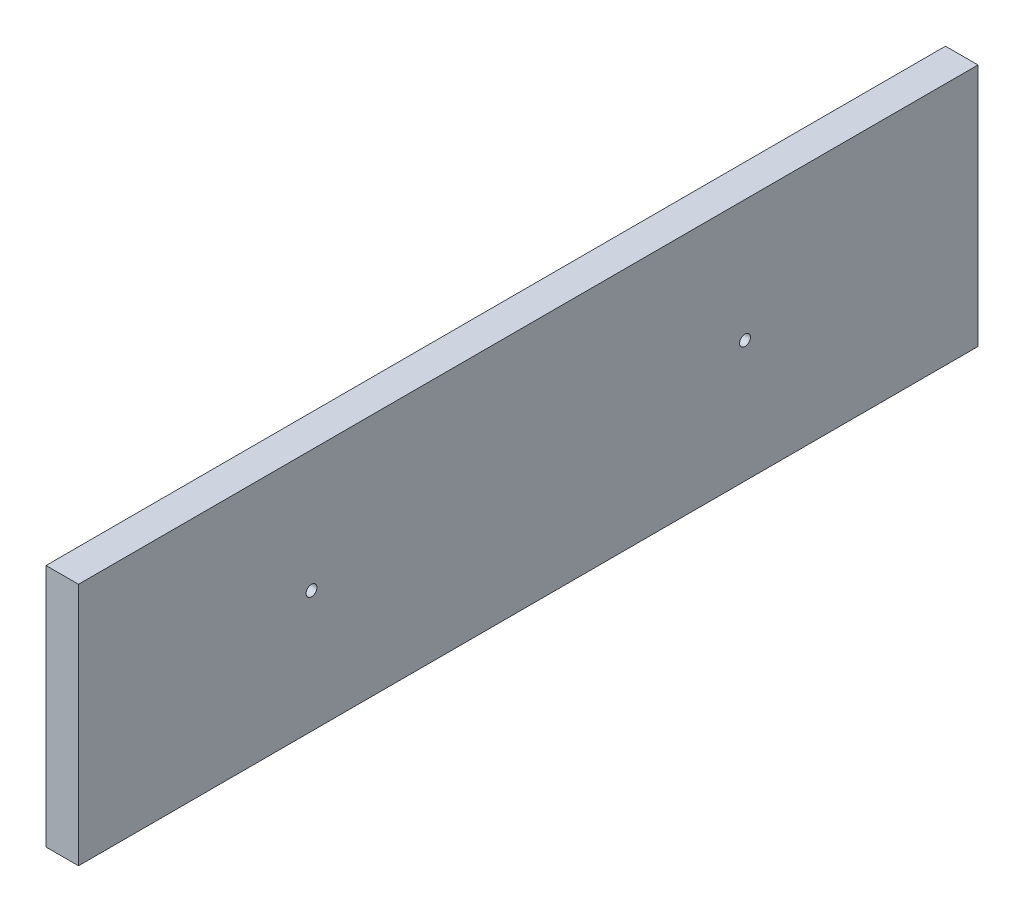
ISO-10303-21;
HEADER;
FILE_DESCRIPTION(('STEP AP214'),'2;1');
FILE_NAME('part.step','',(''),(''),'','','');
FILE_SCHEMA(('AUTOMOTIVE_DESIGN { 1 0 10303 214 1 1 1 1 }'));
ENDSEC;
DATA;
#1=APPLICATION_CONTEXT('core data for automotive mechanical design processes');
#2=APPLICATION_PROTOCOL_DEFINITION('international standard','automotive_design',2000,#1);
#3=PRODUCT_CONTEXT('',#1,'mechanical');
#4=PRODUCT('Part','Part','',(#3));
#5=PRODUCT_RELATED_PRODUCT_CATEGORY('part','',(#4));
#6=PRODUCT_DEFINITION_FORMATION('','',#4);
#7=PRODUCT_DEFINITION_CONTEXT('part definition',#1,'design');
#8=PRODUCT_DEFINITION('design','',#6,#7);
#9=PRODUCT_DEFINITION_SHAPE('','',#8);
#10=(LENGTH_UNIT() NAMED_UNIT(*) SI_UNIT(.MILLI.,.METRE.));
#11=(NAMED_UNIT(*) PLANE_ANGLE_UNIT() SI_UNIT($,.RADIAN.));
#12=(NAMED_UNIT(*) SI_UNIT($,.STERADIAN.) SOLID_ANGLE_UNIT());
#13=UNCERTAINTY_MEASURE_WITH_UNIT(LENGTH_MEASURE(1.E-05),#10,'distance_accuracy_value','');
#14=(GEOMETRIC_REPRESENTATION_CONTEXT(3) GLOBAL_UNCERTAINTY_ASSIGNED_CONTEXT((#13)) GLOBAL_UNIT_ASSIGNED_CONTEXT((#10,
#11,#12)) REPRESENTATION_CONTEXT('',''));
#15=CARTESIAN_POINT('',(0.,0.,0.));
#16=DIRECTION('',(0.,0.,1.));
#17=DIRECTION('',(1.,0.,0.));
#18=AXIS2_PLACEMENT_3D('',#15,#16,#17);
#19=CARTESIAN_POINT('',(0.,0.,1054.1));
#20=DIRECTION('',(1.,0.,0.));
#21=DIRECTION('',(0.,0.,-1.));
#22=AXIS2_PLACEMENT_3D('',#19,#20,#21);
#23=PLANE('',#22);
#24=CARTESIAN_POINT('',(0.,142.875,781.05));
#25=DIRECTION('',(1.,0.,0.));
#26=DIRECTION('',(0.,0.,-1.));
#27=AXIS2_PLACEMENT_3D('',#24,#25,#26);
#28=CIRCLE('',#27,6.34999999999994);
#29=CARTESIAN_POINT('',(0.,142.875,774.7));
#30=VERTEX_POINT('',#29);
#31=EDGE_CURVE('E105',#30,#30,#28,.T.);
#32=ORIENTED_EDGE('',*,*,#31,.T.);
#33=EDGE_LOOP('',(#32));
#34=FACE_BOUND('',#33,.T.);
#35=CARTESIAN_POINT('',(0.,142.875,273.05));
#36=DIRECTION('',(1.,0.,0.));
#37=DIRECTION('',(0.,0.,-1.));
#38=AXIS2_PLACEMENT_3D('',#35,#36,#37);
#39=CIRCLE('',#38,6.34999999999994);
#40=CARTESIAN_POINT('',(0.,142.875,266.7));
#41=VERTEX_POINT('',#40);
#42=EDGE_CURVE('E116',#41,#41,#39,.T.);
#43=ORIENTED_EDGE('',*,*,#42,.T.);
#44=EDGE_LOOP('',(#43));
#45=FACE_BOUND('',#44,.T.);
#46=DIRECTION('',(0.,-1.,0.));
#47=VECTOR('',#46,1.);
#48=CARTESIAN_POINT('',(0.,0.,0.));
#49=LINE('',#48,#47);
#50=CARTESIAN_POINT('',(0.,285.75,0.));
#51=VERTEX_POINT('',#50);
#52=CARTESIAN_POINT('',(0.,0.,0.));
#53=VERTEX_POINT('',#52);
#54=EDGE_CURVE('E102',#51,#53,#49,.T.);
#55=ORIENTED_EDGE('',*,*,#54,.T.);
#56=DIRECTION('',(0.,0.,-1.));
#57=VECTOR('',#56,1.);
#58=CARTESIAN_POINT('',(0.,0.,1054.1));
#59=LINE('',#58,#57);
#60=CARTESIAN_POINT('',(0.,0.,1054.1));
#61=VERTEX_POINT('',#60);
#62=EDGE_CURVE('E11',#61,#53,#59,.T.);
#63=ORIENTED_EDGE('',*,*,#62,.F.);
#64=DIRECTION('',(0.,-1.,0.));
#65=VECTOR('',#64,1.);
#66=CARTESIAN_POINT('',(0.,0.,1054.1));
#67=LINE('',#66,#65);
#68=CARTESIAN_POINT('',(0.,285.75,1054.1));
#69=VERTEX_POINT('',#68);
#70=EDGE_CURVE('E90',#69,#61,#67,.T.);
#71=ORIENTED_EDGE('',*,*,#70,.F.);
#72=DIRECTION('',(0.,0.,-1.));
#73=VECTOR('',#72,1.);
#74=CARTESIAN_POINT('',(0.,285.75,1054.1));
#75=LINE('',#74,#73);
#76=EDGE_CURVE('E98',#69,#51,#75,.T.);
#77=ORIENTED_EDGE('',*,*,#76,.T.);
#78=EDGE_LOOP('',(#55,#63,#71,#77));
#79=FACE_BOUND('',#78,.T.);
#80=ADVANCED_FACE('F39',(#34,#45,#79),#23,.F.);
#81=CARTESIAN_POINT('',(0.,0.,1054.1));
#82=DIRECTION('',(0.,1.,0.));
#83=DIRECTION('',(0.,0.,1.));
#84=AXIS2_PLACEMENT_3D('',#81,#82,#83);
#85=PLANE('',#84);
#86=DIRECTION('',(1.,0.,0.));
#87=VECTOR('',#86,1.);
#88=CARTESIAN_POINT('',(0.,0.,0.));
#89=LINE('',#88,#87);
#90=CARTESIAN_POINT('',(38.1,0.,0.));
#91=VERTEX_POINT('',#90);
#92=EDGE_CURVE('E94',#53,#91,#89,.T.);
#93=ORIENTED_EDGE('',*,*,#92,.T.);
#94=DIRECTION('',(0.,0.,-1.));
#95=VECTOR('',#94,1.);
#96=CARTESIAN_POINT('',(38.1,0.,1054.1));
#97=LINE('',#96,#95);
#98=CARTESIAN_POINT('',(38.1,0.,1054.1));
#99=VERTEX_POINT('',#98);
#100=EDGE_CURVE('E47',#99,#91,#97,.T.);
#101=ORIENTED_EDGE('',*,*,#100,.F.);
#102=DIRECTION('',(1.,0.,0.));
#103=VECTOR('',#102,1.);
#104=CARTESIAN_POINT('',(0.,0.,1054.1));
#105=LINE('',#104,#103);
#106=EDGE_CURVE('E85',#61,#99,#105,.T.);
#107=ORIENTED_EDGE('',*,*,#106,.F.);
#108=ORIENTED_EDGE('',*,*,#62,.T.);
#109=EDGE_LOOP('',(#93,#101,#107,#108));
#110=FACE_BOUND('',#109,.T.);
#111=ADVANCED_FACE('F93',(#110),#85,.F.);
#112=CARTESIAN_POINT('',(38.1,0.,1054.1));
#113=DIRECTION('',(-1.,0.,0.));
#114=DIRECTION('',(0.,-1.,0.));
#115=AXIS2_PLACEMENT_3D('',#112,#113,#114);
#116=PLANE('',#115);
#117=CARTESIAN_POINT('',(38.1,142.875,781.05));
#118=DIRECTION('',(1.,0.,0.));
#119=DIRECTION('',(0.,0.,-1.));
#120=AXIS2_PLACEMENT_3D('',#117,#118,#119);
#121=CIRCLE('',#120,6.34999999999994);
#122=CARTESIAN_POINT('',(38.1,142.875,774.7));
#123=VERTEX_POINT('',#122);
#124=EDGE_CURVE('E122',#123,#123,#121,.T.);
#125=ORIENTED_EDGE('',*,*,#124,.F.);
#126=EDGE_LOOP('',(#125));
#127=FACE_BOUND('',#126,.T.);
#128=CARTESIAN_POINT('',(38.1,142.875,273.05));
#129=DIRECTION('',(1.,0.,0.));
#130=DIRECTION('',(0.,0.,-1.));
#131=AXIS2_PLACEMENT_3D('',#128,#129,#130);
#132=CIRCLE('',#131,6.34999999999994);
#133=CARTESIAN_POINT('',(38.1,142.875,266.7));
#134=VERTEX_POINT('',#133);
#135=EDGE_CURVE('E119',#134,#134,#132,.T.);
#136=ORIENTED_EDGE('',*,*,#135,.F.);
#137=EDGE_LOOP('',(#136));
#138=FACE_BOUND('',#137,.T.);
#139=DIRECTION('',(0.,1.,0.));
#140=VECTOR('',#139,1.);
#141=CARTESIAN_POINT('',(38.1,0.,0.));
#142=LINE('',#141,#140);
#143=CARTESIAN_POINT('',(38.1,285.75,0.));
#144=VERTEX_POINT('',#143);
#145=EDGE_CURVE('E72',#91,#144,#142,.T.);
#146=ORIENTED_EDGE('',*,*,#145,.T.);
#147=DIRECTION('',(0.,0.,-1.));
#148=VECTOR('',#147,1.);
#149=CARTESIAN_POINT('',(38.1,285.75,1054.1));
#150=LINE('',#149,#148);
#151=CARTESIAN_POINT('',(38.1,285.75,1054.1));
#152=VERTEX_POINT('',#151);
#153=EDGE_CURVE('E95',#152,#144,#150,.T.);
#154=ORIENTED_EDGE('',*,*,#153,.F.);
#155=DIRECTION('',(0.,1.,0.));
#156=VECTOR('',#155,1.);
#157=CARTESIAN_POINT('',(38.1,0.,1054.1));
#158=LINE('',#157,#156);
#159=EDGE_CURVE('E88',#99,#152,#158,.T.);
#160=ORIENTED_EDGE('',*,*,#159,.F.);
#161=ORIENTED_EDGE('',*,*,#100,.T.);
#162=EDGE_LOOP('',(#146,#154,#160,#161));
#163=FACE_BOUND('',#162,.T.);
#164=ADVANCED_FACE('F96',(#127,#138,#163),#116,.F.);
#165=CARTESIAN_POINT('',(0.,285.75,1054.1));
#166=DIRECTION('',(0.,-1.,0.));
#167=DIRECTION('',(0.,0.,-1.));
#168=AXIS2_PLACEMENT_3D('',#165,#166,#167);
#169=PLANE('',#168);
#170=DIRECTION('',(-1.,0.,0.));
#171=VECTOR('',#170,1.);
#172=CARTESIAN_POINT('',(0.,285.75,0.));
#173=LINE('',#172,#171);
#174=EDGE_CURVE('E78',#144,#51,#173,.T.);
#175=ORIENTED_EDGE('',*,*,#174,.T.);
#176=ORIENTED_EDGE('',*,*,#76,.F.);
#177=DIRECTION('',(-1.,0.,0.));
#178=VECTOR('',#177,1.);
#179=CARTESIAN_POINT('',(0.,285.75,1054.1));
#180=LINE('',#179,#178);
#181=EDGE_CURVE('E55',#152,#69,#180,.T.);
#182=ORIENTED_EDGE('',*,*,#181,.F.);
#183=ORIENTED_EDGE('',*,*,#153,.T.);
#184=EDGE_LOOP('',(#175,#176,#182,#183));
#185=FACE_BOUND('',#184,.T.);
#186=ADVANCED_FACE('F110',(#185),#169,.F.);
#187=CARTESIAN_POINT('',(0.,0.,1054.1));
#188=DIRECTION('',(0.,0.,-1.));
#189=DIRECTION('',(-1.,0.,0.));
#190=AXIS2_PLACEMENT_3D('',#187,#188,#189);
#191=PLANE('',#190);
#192=ORIENTED_EDGE('',*,*,#70,.T.);
#193=ORIENTED_EDGE('',*,*,#106,.T.);
#194=ORIENTED_EDGE('',*,*,#159,.T.);
#195=ORIENTED_EDGE('',*,*,#181,.T.);
#196=EDGE_LOOP('',(#192,#193,#194,#195));
#197=FACE_BOUND('',#196,.T.);
#198=ADVANCED_FACE('F86',(#197),#191,.F.);
#199=CARTESIAN_POINT('',(0.,0.,0.));
#200=DIRECTION('',(0.,0.,-1.));
#201=DIRECTION('',(-1.,0.,0.));
#202=AXIS2_PLACEMENT_3D('',#199,#200,#201);
#203=PLANE('',#202);
#204=ORIENTED_EDGE('',*,*,#54,.F.);
#205=ORIENTED_EDGE('',*,*,#174,.F.);
#206=ORIENTED_EDGE('',*,*,#145,.F.);
#207=ORIENTED_EDGE('',*,*,#92,.F.);
#208=EDGE_LOOP('',(#204,#205,#206,#207));
#209=FACE_BOUND('',#208,.T.);
#210=ADVANCED_FACE('F113',(#209),#203,.T.);
#211=CARTESIAN_POINT('',(0.,142.875,273.05));
#212=DIRECTION('',(1.,0.,0.));
#213=DIRECTION('',(0.,0.,-1.));
#214=AXIS2_PLACEMENT_3D('',#211,#212,#213);
#215=CYLINDRICAL_SURFACE('',#214,6.34999999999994);
#216=ORIENTED_EDGE('',*,*,#42,.F.);
#217=EDGE_LOOP('',(#216));
#218=FACE_BOUND('',#217,.T.);
#219=ORIENTED_EDGE('',*,*,#135,.T.);
#220=EDGE_LOOP('',(#219));
#221=FACE_BOUND('',#220,.T.);
#222=ADVANCED_FACE('F133',(#218,#221),#215,.F.);
#223=CARTESIAN_POINT('',(0.,142.875,781.05));
#224=DIRECTION('',(1.,0.,0.));
#225=DIRECTION('',(0.,0.,-1.));
#226=AXIS2_PLACEMENT_3D('',#223,#224,#225);
#227=CYLINDRICAL_SURFACE('',#226,6.34999999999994);
#228=ORIENTED_EDGE('',*,*,#31,.F.);
#229=EDGE_LOOP('',(#228));
#230=FACE_BOUND('',#229,.T.);
#231=ORIENTED_EDGE('',*,*,#124,.T.);
#232=EDGE_LOOP('',(#231));
#233=FACE_BOUND('',#232,.T.);
#234=ADVANCED_FACE('F130',(#230,#233),#227,.F.);
#235=CLOSED_SHELL('',(#80,#111,#164,#186,#198,#210,#222,#234));
#236=MANIFOLD_SOLID_BREP('B2',#235);
#237=ADVANCED_BREP_SHAPE_REPRESENTATION('',(#18,#236),#14);
#238=SHAPE_DEFINITION_REPRESENTATION(#9,#237);
ENDSEC;
END-ISO-10303-21;
